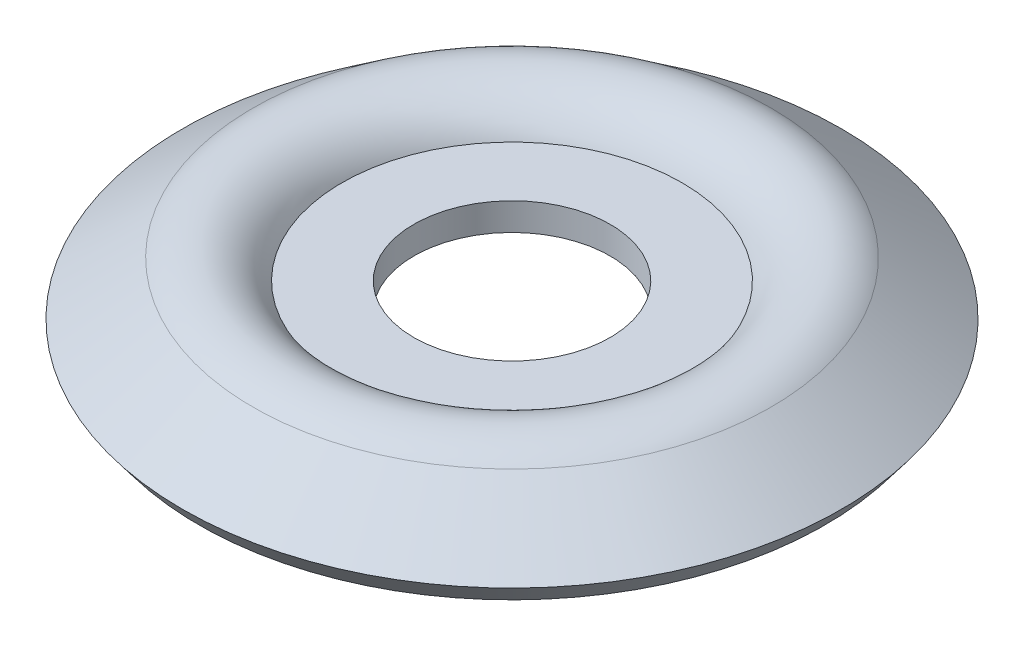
ISO-10303-21;
HEADER;
FILE_DESCRIPTION(('STEP AP214'),'2;1');
FILE_NAME('part.step','',(''),(''),'','','');
FILE_SCHEMA(('AUTOMOTIVE_DESIGN { 1 0 10303 214 1 1 1 1 }'));
ENDSEC;
DATA;
#1=APPLICATION_CONTEXT('core data for automotive mechanical design processes');
#2=APPLICATION_PROTOCOL_DEFINITION('international standard','automotive_design',2000,#1);
#3=PRODUCT_CONTEXT('',#1,'mechanical');
#4=PRODUCT('Part','Part','',(#3));
#5=PRODUCT_RELATED_PRODUCT_CATEGORY('part','',(#4));
#6=PRODUCT_DEFINITION_FORMATION('','',#4);
#7=PRODUCT_DEFINITION_CONTEXT('part definition',#1,'design');
#8=PRODUCT_DEFINITION('design','',#6,#7);
#9=PRODUCT_DEFINITION_SHAPE('','',#8);
#10=(LENGTH_UNIT() NAMED_UNIT(*) SI_UNIT(.MILLI.,.METRE.));
#11=(NAMED_UNIT(*) PLANE_ANGLE_UNIT() SI_UNIT($,.RADIAN.));
#12=(NAMED_UNIT(*) SI_UNIT($,.STERADIAN.) SOLID_ANGLE_UNIT());
#13=UNCERTAINTY_MEASURE_WITH_UNIT(LENGTH_MEASURE(1.E-05),#10,'distance_accuracy_value','');
#14=(GEOMETRIC_REPRESENTATION_CONTEXT(3) GLOBAL_UNCERTAINTY_ASSIGNED_CONTEXT((#13)) GLOBAL_UNIT_ASSIGNED_CONTEXT((#10,
#11,#12)) REPRESENTATION_CONTEXT('',''));
#15=CARTESIAN_POINT('',(0.,0.,0.));
#16=DIRECTION('',(0.,0.,1.));
#17=DIRECTION('',(1.,0.,0.));
#18=AXIS2_PLACEMENT_3D('',#15,#16,#17);
#19=CARTESIAN_POINT('',(0.,2.54,0.));
#20=DIRECTION('',(0.,1.,0.));
#21=DIRECTION('',(0.,0.,1.));
#22=AXIS2_PLACEMENT_3D('',#19,#20,#21);
#23=PLANE('',#22);
#24=CARTESIAN_POINT('',(0.,2.54,0.));
#25=DIRECTION('',(0.,1.,0.));
#26=DIRECTION('',(0.,0.,1.));
#27=AXIS2_PLACEMENT_3D('',#24,#25,#26);
#28=CIRCLE('',#27,9.0805);
#29=CARTESIAN_POINT('',(0.,2.54,9.0805));
#30=VERTEX_POINT('',#29);
#31=EDGE_CURVE('E54',#30,#30,#28,.T.);
#32=ORIENTED_EDGE('',*,*,#31,.F.);
#33=EDGE_LOOP('',(#32));
#34=FACE_BOUND('',#33,.T.);
#35=CARTESIAN_POINT('',(0.,2.54,0.));
#36=DIRECTION('',(0.,-1.,0.));
#37=DIRECTION('',(0.,0.,-1.));
#38=AXIS2_PLACEMENT_3D('',#35,#36,#37);
#39=CIRCLE('',#38,15.7315342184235);
#40=CARTESIAN_POINT('',(0.,2.54,-15.7315342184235));
#41=VERTEX_POINT('',#40);
#42=EDGE_CURVE('E51',#41,#41,#39,.T.);
#43=ORIENTED_EDGE('',*,*,#42,.F.);
#44=EDGE_LOOP('',(#43));
#45=FACE_BOUND('',#44,.T.);
#46=ADVANCED_FACE('F29',(#34,#45),#23,.T.);
#47=CARTESIAN_POINT('',(0.,0.,0.));
#48=DIRECTION('',(0.,1.,0.));
#49=DIRECTION('',(0.,0.,1.));
#50=AXIS2_PLACEMENT_3D('',#47,#48,#49);
#51=PLANE('',#50);
#52=CARTESIAN_POINT('',(0.,0.,0.));
#53=DIRECTION('',(0.,1.,0.));
#54=DIRECTION('',(0.,0.,1.));
#55=AXIS2_PLACEMENT_3D('',#52,#53,#54);
#56=CIRCLE('',#55,9.0805);
#57=CARTESIAN_POINT('',(0.,0.,9.0805));
#58=VERTEX_POINT('',#57);
#59=EDGE_CURVE('E32',#58,#58,#56,.T.);
#60=ORIENTED_EDGE('',*,*,#59,.T.);
#61=EDGE_LOOP('',(#60));
#62=FACE_BOUND('',#61,.T.);
#63=CARTESIAN_POINT('',(0.,0.,0.));
#64=DIRECTION('',(0.,-1.,0.));
#65=DIRECTION('',(0.,0.,-1.));
#66=AXIS2_PLACEMENT_3D('',#63,#64,#65);
#67=CIRCLE('',#66,17.653);
#68=CARTESIAN_POINT('',(0.,0.,-17.653));
#69=VERTEX_POINT('',#68);
#70=EDGE_CURVE('E10',#69,#69,#67,.T.);
#71=ORIENTED_EDGE('',*,*,#70,.T.);
#72=EDGE_LOOP('',(#71));
#73=FACE_BOUND('',#72,.T.);
#74=ADVANCED_FACE('F61',(#62,#73),#51,.F.);
#75=CARTESIAN_POINT('',(0.,0.,0.));
#76=DIRECTION('',(0.,-1.,0.));
#77=DIRECTION('',(0.,0.,-1.));
#78=AXIS2_PLACEMENT_3D('',#75,#76,#77);
#79=TOROIDAL_SURFACE('',#78,20.6375,2.9845);
#80=ORIENTED_EDGE('',*,*,#70,.F.);
#81=EDGE_LOOP('',(#80));
#82=FACE_BOUND('',#81,.T.);
#83=CARTESIAN_POINT('',(0.,2.38202416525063,0.));
#84=DIRECTION('',(0.,-1.,0.));
#85=DIRECTION('',(0.,0.,-1.));
#86=AXIS2_PLACEMENT_3D('',#83,#84,#85);
#87=CIRCLE('',#86,22.4356104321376);
#88=CARTESIAN_POINT('',(0.,2.38202416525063,-22.4356104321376));
#89=VERTEX_POINT('',#88);
#90=EDGE_CURVE('E36',#89,#89,#87,.T.);
#91=ORIENTED_EDGE('',*,*,#90,.T.);
#92=EDGE_LOOP('',(#91));
#93=FACE_BOUND('',#92,.T.);
#94=ADVANCED_FACE('F78',(#82,#93),#79,.F.);
#95=CARTESIAN_POINT('',(0.,-2.54,0.));
#96=DIRECTION('',(0.,-1.,0.));
#97=DIRECTION('',(0.,0.,-1.));
#98=AXIS2_PLACEMENT_3D('',#95,#96,#97);
#99=CONICAL_SURFACE('',#98,28.956,0.924187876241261);
#100=ORIENTED_EDGE('',*,*,#90,.F.);
#101=EDGE_LOOP('',(#100));
#102=FACE_BOUND('',#101,.T.);
#103=CARTESIAN_POINT('',(0.,-2.54,0.));
#104=DIRECTION('',(0.,-1.,0.));
#105=DIRECTION('',(0.,0.,-1.));
#106=AXIS2_PLACEMENT_3D('',#103,#104,#105);
#107=CIRCLE('',#106,28.956);
#108=CARTESIAN_POINT('',(0.,-2.54,-28.956));
#109=VERTEX_POINT('',#108);
#110=EDGE_CURVE('E40',#109,#109,#107,.T.);
#111=ORIENTED_EDGE('',*,*,#110,.T.);
#112=EDGE_LOOP('',(#111));
#113=FACE_BOUND('',#112,.T.);
#114=ADVANCED_FACE('F91',(#102,#113),#99,.F.);
#115=CARTESIAN_POINT('',(0.,-0.512745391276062,0.));
#116=DIRECTION('',(0.,1.,0.));
#117=DIRECTION('',(0.,0.,1.));
#118=AXIS2_PLACEMENT_3D('',#115,#116,#117);
#119=CONICAL_SURFACE('',#118,30.4863067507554,0.646608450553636);
#120=ORIENTED_EDGE('',*,*,#110,.F.);
#121=EDGE_LOOP('',(#120));
#122=FACE_BOUND('',#121,.T.);
#123=CARTESIAN_POINT('',(0.,-0.512745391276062,0.));
#124=DIRECTION('',(0.,-1.,0.));
#125=DIRECTION('',(0.,0.,-1.));
#126=AXIS2_PLACEMENT_3D('',#123,#124,#125);
#127=CIRCLE('',#126,30.4863067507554);
#128=CARTESIAN_POINT('',(0.,-0.512745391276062,-30.4863067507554));
#129=VERTEX_POINT('',#128);
#130=EDGE_CURVE('E45',#129,#129,#127,.T.);
#131=ORIENTED_EDGE('',*,*,#130,.T.);
#132=EDGE_LOOP('',(#131));
#133=FACE_BOUND('',#132,.T.);
#134=ADVANCED_FACE('F86',(#122,#133),#119,.T.);
#135=CARTESIAN_POINT('',(0.,-0.512745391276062,0.));
#136=DIRECTION('',(0.,-1.,0.));
#137=DIRECTION('',(0.,0.,-1.));
#138=AXIS2_PLACEMENT_3D('',#135,#136,#137);
#139=CONICAL_SURFACE('',#138,30.4863067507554,0.924187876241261);
#140=CARTESIAN_POINT('',(0.,4.40927877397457,0.));
#141=DIRECTION('',(0.,-1.,0.));
#142=DIRECTION('',(0.,0.,-1.));
#143=AXIS2_PLACEMENT_3D('',#140,#141,#142);
#144=CIRCLE('',#143,23.965917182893);
#145=CARTESIAN_POINT('',(0.,4.40927877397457,-23.965917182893));
#146=VERTEX_POINT('',#145);
#147=EDGE_CURVE('E48',#146,#146,#144,.T.);
#148=ORIENTED_EDGE('',*,*,#147,.T.);
#149=EDGE_LOOP('',(#148));
#150=FACE_BOUND('',#149,.T.);
#151=ORIENTED_EDGE('',*,*,#130,.F.);
#152=EDGE_LOOP('',(#151));
#153=FACE_BOUND('',#152,.T.);
#154=ADVANCED_FACE('F70',(#150,#153),#139,.T.);
#155=CARTESIAN_POINT('',(0.,0.,0.));
#156=DIRECTION('',(0.,-1.,0.));
#157=DIRECTION('',(0.,0.,-1.));
#158=AXIS2_PLACEMENT_3D('',#155,#156,#157);
#159=TOROIDAL_SURFACE('',#158,20.6375,5.5245);
#160=ORIENTED_EDGE('',*,*,#42,.T.);
#161=EDGE_LOOP('',(#160));
#162=FACE_BOUND('',#161,.T.);
#163=ORIENTED_EDGE('',*,*,#147,.F.);
#164=EDGE_LOOP('',(#163));
#165=FACE_BOUND('',#164,.T.);
#166=ADVANCED_FACE('F65',(#162,#165),#159,.T.);
#167=CARTESIAN_POINT('',(0.,-2.54,0.));
#168=DIRECTION('',(0.,1.,0.));
#169=DIRECTION('',(0.,0.,1.));
#170=AXIS2_PLACEMENT_3D('',#167,#168,#169);
#171=CYLINDRICAL_SURFACE('',#170,9.0805);
#172=ORIENTED_EDGE('',*,*,#31,.T.);
#173=EDGE_LOOP('',(#172));
#174=FACE_BOUND('',#173,.T.);
#175=ORIENTED_EDGE('',*,*,#59,.F.);
#176=EDGE_LOOP('',(#175));
#177=FACE_BOUND('',#176,.T.);
#178=ADVANCED_FACE('F63',(#174,#177),#171,.F.);
#179=CLOSED_SHELL('',(#46,#74,#94,#114,#134,#154,#166,#178));
#180=MANIFOLD_SOLID_BREP('B2',#179);
#181=ADVANCED_BREP_SHAPE_REPRESENTATION('',(#18,#180),#14);
#182=SHAPE_DEFINITION_REPRESENTATION(#9,#181);
ENDSEC;
END-ISO-10303-21;
